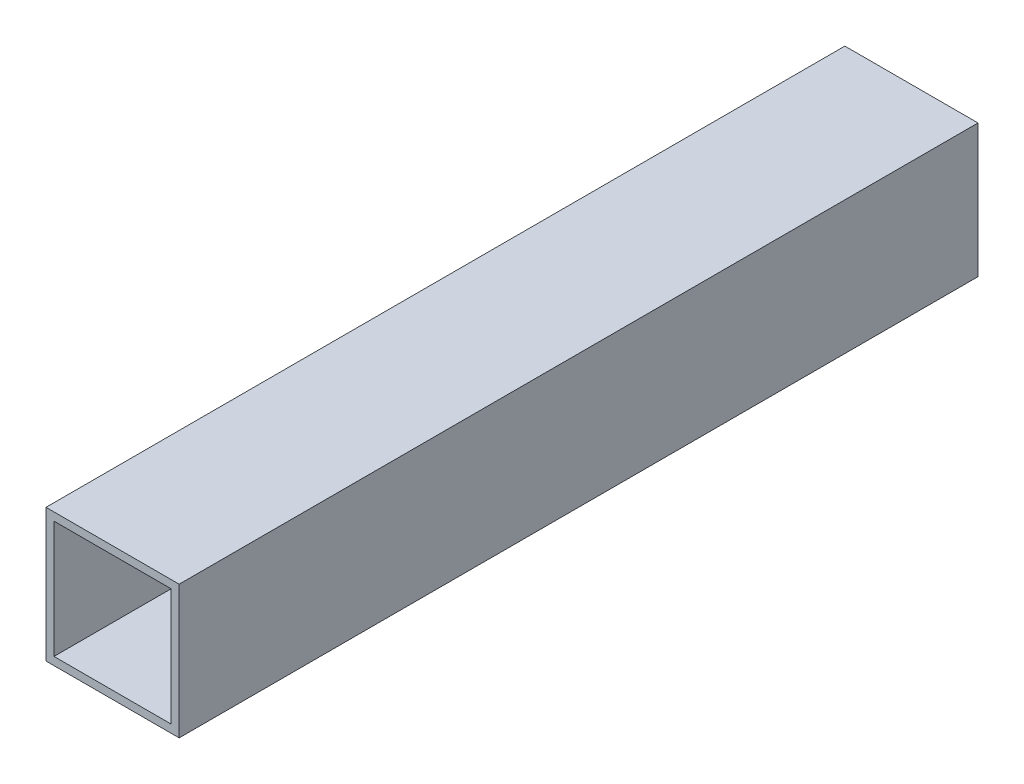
from build123d import *

# Parameters (mm, degrees)
SKETCH_1_W      = 25
SKETCH_1_H      = 25
SKETCH_1_W_2    = 22
SKETCH_1_H_2    = 22
EXTRUDE_1_DEPTH = 150


with BuildPart() as part:
    # Sketch 1 → Extrude 1 (new body)
    with BuildSketch(Plane.XY):
        with Locations((-29.5, -55.7)):
            Rectangle(SKETCH_1_W, SKETCH_1_H)
        with Locations((-29.5, -55.7)):
            Rectangle(SKETCH_1_W_2, SKETCH_1_H_2, mode=Mode.SUBTRACT)
    extrude(amount=-EXTRUDE_1_DEPTH)


solid = part.part
